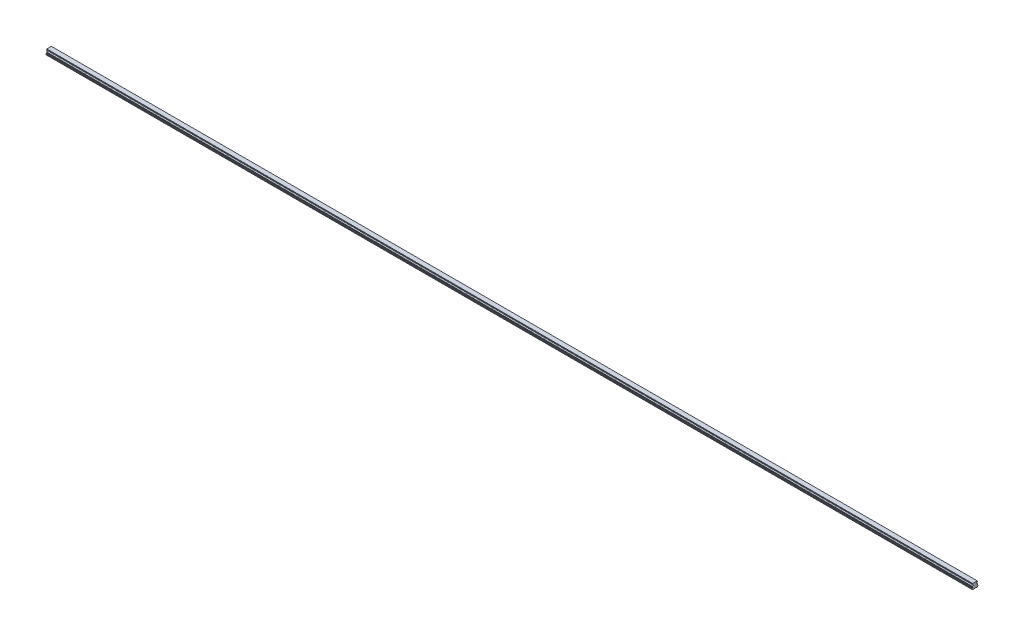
from build123d import *

# Parameters (mm, degrees)
BOSS_EXTRUDE1_DEPTH        = 3780
SKETCH3_R                  = 3
SKETCH3_R_2                = 2.5
CUT_EXTRUDE3_DEPTH         = 12
SKETCH3_2_R                = 2.5
CUT_EXTRUDE4_DEPTH         = 15
CHAMFER1_SIZE              = 0.5
LPATTERN4_COUNT            = 63
LPATTERN4_PITCH            = 60
CHAMFER1_OF_LPATTERN4_SIZE = 0.5


with BuildPart() as part:
    # Sketch1 → Boss-Extrude1 (new body)
    with BuildSketch(Plane(origin=(0, 0, 0), x_dir=(0, 0, -1), z_dir=(1, 0, 0))):
        with BuildLine():
            Line((9.375, 21.8), (-9.375, 21.8))
            Line((-9.375, 21.8), (-9.375, 20.756))
            Line((-9.375, 20.756), (-10, 19.415683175))
            Line((-10, 19.415683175), (-10, 17.685449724))
            ThreePointArc((-10, 17.685449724), (-7.2, 14.6), (-10, 11.514550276))
            Line((-10, 11.514550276), (-10, 9.784316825))
            Line((-10, 9.784316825), (-9.375, 8.444))
            Line((-9.375, 8.444), (-9.922688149, 6.4))
            Line((-9.922688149, 6.4), (-12.5, 5.489338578))
            Line((-12.5, 5.489338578), (-12.5, 2.65))
            Line((-12.5, 2.65), (-9.85, 0))
            Line((-9.85, 0), (-5.5, 0))
            Line((-5.5, 0), (-5, 0.5))
            Line((-5, 0.5), (5, 0.5))
            Line((5, 0.5), (5.5, 0))
            Line((5.5, 0), (9.85, 0))
            Line((9.85, 0), (12.5, 2.65))
            Line((12.5, 2.65), (12.5, 5.489338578))
            Line((12.5, 5.489338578), (9.922688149, 6.4))
            Line((9.922688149, 6.4), (9.375, 8.444))
            Line((9.375, 8.444), (10, 9.784316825))
            Line((10, 9.784316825), (10, 11.514550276))
            ThreePointArc((10, 11.514550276), (7.2, 14.6), (10, 17.685449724))
            Line((10, 17.685449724), (10, 19.415683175))
            Line((10, 19.415683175), (9.375, 20.756))
            Line((9.375, 20.756), (9.375, 21.8))
        make_face()
    extrude(amount=BOSS_EXTRUDE1_DEPTH)

    # Sketch3 → Cut-Extrude3 (cut)
    with BuildSketch(Plane.XZ):
        with Locations(Location((30, 0, 0), (0, 0, 270))):
            Circle(SKETCH3_R)
        with Locations(Location((30, 0, 0), (0, 0, 270))):
            Circle(SKETCH3_R_2, mode=Mode.SUBTRACT)
    cut_extrude3 = extrude(amount=-CUT_EXTRUDE3_DEPTH, mode=Mode.SUBTRACT)

    # Sketch3_2 → Cut-Extrude4 (cut)
    with BuildSketch(Plane.XZ):
        with Locations(Location((30, 0, 0), (0, 0, 270))):
            Circle(SKETCH3_2_R)
    cut_extrude4 = extrude(amount=-CUT_EXTRUDE4_DEPTH, mode=Mode.SUBTRACT)

    # Cut-Extrude5 cone 1 section (on through the dimple's axis) → Cut-Extrude5 (revolve, cut)
    with BuildSketch(Plane(origin=(30, 15, 0), x_dir=(0, 0, -1), z_dir=(1, 0, 0))):
        Polygon((0, 0), (2.5, 0), (0, 1.443375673), align=None)
    cut_extrude5 = revolve(axis=Axis((30, 15, 0), (0, 1, 0)), mode=Mode.SUBTRACT)

    # Chamfer1
    chamfer1_edges = [part.edges().sort_by_distance(p)[0] for p in [
        (30, 0.5, 3),
    ]]
    chamfer(chamfer1_edges, length=CHAMFER1_SIZE)

    # LPattern4: Cut-Extrude3, Cut-Extrude4, Cut-Extrude5 ×63
    with Locations(*[(i * LPATTERN4_PITCH, 0, 0) for i in range(1, LPATTERN4_COUNT)]):
        add(cut_extrude3, mode=Mode.SUBTRACT)
        add(cut_extrude4, mode=Mode.SUBTRACT)
        add(cut_extrude5, mode=Mode.SUBTRACT)

    # Chamfer1 of LPattern4
    chamfer1_of_lpattern4_edges = [part.edges().sort_by_distance(p)[0] for p in [
        (90, 0.5, 3),
        (150, 0.5, 3),
        (210, 0.5, 3),
        (270, 0.5, 3),
        (330, 0.5, 3),
        (390, 0.5, 3),
        (450, 0.5, 3),
        (510, 0.5, 3),
        (570, 0.5, 3),
        (630, 0.5, 3),
        (690, 0.5, 3),
        (750, 0.5, 3),
        (810, 0.5, 3),
        (870, 0.5, 3),
        (930, 0.5, 3),
        (990, 0.5, 3),
        (1050, 0.5, 3),
        (1110, 0.5, 3),
        (1170, 0.5, 3),
        (1230, 0.5, 3),
        (1290, 0.5, 3),
        (1350, 0.5, 3),
        (1410, 0.5, 3),
        (1470, 0.5, 3),
        (1530, 0.5, 3),
        (1590, 0.5, 3),
        (1650, 0.5, 3),
        (1710, 0.5, 3),
        (1770, 0.5, 3),
        (1830, 0.5, 3),
        (1890, 0.5, 3),
        (1950, 0.5, 3),
        (2010, 0.5, 3),
        (2070, 0.5, 3),
        (2130, 0.5, 3),
        (2190, 0.5, 3),
        (2250, 0.5, 3),
        (2310, 0.5, 3),
        (2370, 0.5, 3),
        (2430, 0.5, 3),
        (2490, 0.5, 3),
        (2550, 0.5, 3),
        (2610, 0.5, 3),
        (2670, 0.5, 3),
        (2730, 0.5, 3),
        (2790, 0.5, 3),
        (2850, 0.5, 3),
        (2910, 0.5, 3),
        (2970, 0.5, 3),
        (3030, 0.5, 3),
        (3090, 0.5, 3),
        (3150, 0.5, 3),
        (3210, 0.5, 3),
        (3270, 0.5, 3),
        (3330, 0.5, 3),
        (3390, 0.5, 3),
        (3450, 0.5, 3),
        (3510, 0.5, 3),
        (3570, 0.5, 3),
        (3630, 0.5, 3),
        (3690, 0.5, 3),
        (3750, 0.5, 3),
    ]]
    chamfer(chamfer1_of_lpattern4_edges, length=CHAMFER1_OF_LPATTERN4_SIZE)


solid = part.part
